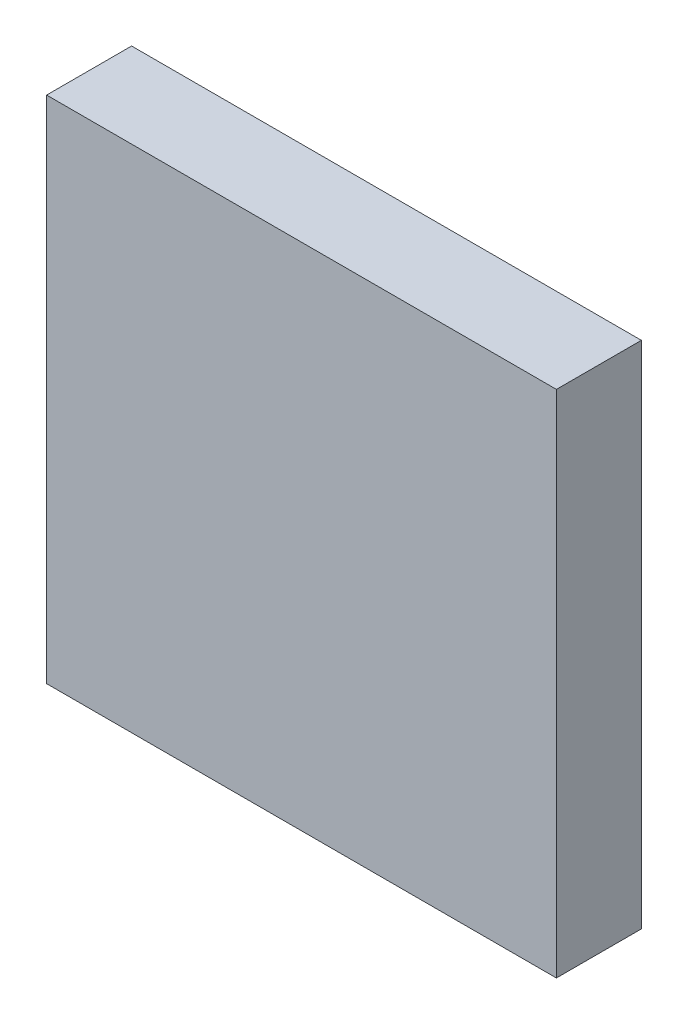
ISO-10303-21;
HEADER;
FILE_DESCRIPTION(('STEP AP214'),'2;1');
FILE_NAME('part.step','',(''),(''),'','','');
FILE_SCHEMA(('AUTOMOTIVE_DESIGN { 1 0 10303 214 1 1 1 1 }'));
ENDSEC;
DATA;
#1=APPLICATION_CONTEXT('core data for automotive mechanical design processes');
#2=APPLICATION_PROTOCOL_DEFINITION('international standard','automotive_design',2000,#1);
#3=PRODUCT_CONTEXT('',#1,'mechanical');
#4=PRODUCT('Part','Part','',(#3));
#5=PRODUCT_RELATED_PRODUCT_CATEGORY('part','',(#4));
#6=PRODUCT_DEFINITION_FORMATION('','',#4);
#7=PRODUCT_DEFINITION_CONTEXT('part definition',#1,'design');
#8=PRODUCT_DEFINITION('design','',#6,#7);
#9=PRODUCT_DEFINITION_SHAPE('','',#8);
#10=(LENGTH_UNIT() NAMED_UNIT(*) SI_UNIT(.MILLI.,.METRE.));
#11=(NAMED_UNIT(*) PLANE_ANGLE_UNIT() SI_UNIT($,.RADIAN.));
#12=(NAMED_UNIT(*) SI_UNIT($,.STERADIAN.) SOLID_ANGLE_UNIT());
#13=UNCERTAINTY_MEASURE_WITH_UNIT(LENGTH_MEASURE(1.E-05),#10,'distance_accuracy_value','');
#14=(GEOMETRIC_REPRESENTATION_CONTEXT(3) GLOBAL_UNCERTAINTY_ASSIGNED_CONTEXT((#13)) GLOBAL_UNIT_ASSIGNED_CONTEXT((#10,
#11,#12)) REPRESENTATION_CONTEXT('',''));
#15=CARTESIAN_POINT('',(0.,0.,0.));
#16=DIRECTION('',(0.,0.,1.));
#17=DIRECTION('',(1.,0.,0.));
#18=AXIS2_PLACEMENT_3D('',#15,#16,#17);
#19=CARTESIAN_POINT('',(0.,0.,1.));
#20=DIRECTION('',(0.,0.,1.));
#21=DIRECTION('',(1.,0.,0.));
#22=AXIS2_PLACEMENT_3D('',#19,#20,#21);
#23=PLANE('',#22);
#24=DIRECTION('',(0.,1.,0.));
#25=VECTOR('',#24,1.);
#26=CARTESIAN_POINT('',(-3.,3.,1.));
#27=LINE('',#26,#25);
#28=CARTESIAN_POINT('',(-3.,-3.,1.));
#29=VERTEX_POINT('',#28);
#30=CARTESIAN_POINT('',(-3.,3.,1.));
#31=VERTEX_POINT('',#30);
#32=EDGE_CURVE('E67',#29,#31,#27,.T.);
#33=ORIENTED_EDGE('',*,*,#32,.F.);
#34=DIRECTION('',(1.,0.,0.));
#35=VECTOR('',#34,1.);
#36=CARTESIAN_POINT('',(-3.,-3.,1.));
#37=LINE('',#36,#35);
#38=CARTESIAN_POINT('',(3.,-3.,1.));
#39=VERTEX_POINT('',#38);
#40=EDGE_CURVE('E19',#39,#29,#37,.F.);
#41=ORIENTED_EDGE('',*,*,#40,.F.);
#42=DIRECTION('',(0.,1.,0.));
#43=VECTOR('',#42,1.);
#44=CARTESIAN_POINT('',(3.,-3.,1.));
#45=LINE('',#44,#43);
#46=CARTESIAN_POINT('',(3.,3.,1.));
#47=VERTEX_POINT('',#46);
#48=EDGE_CURVE('E57',#47,#39,#45,.F.);
#49=ORIENTED_EDGE('',*,*,#48,.F.);
#50=DIRECTION('',(1.,0.,0.));
#51=VECTOR('',#50,1.);
#52=CARTESIAN_POINT('',(3.,3.,1.));
#53=LINE('',#52,#51);
#54=EDGE_CURVE('E52',#31,#47,#53,.T.);
#55=ORIENTED_EDGE('',*,*,#54,.F.);
#56=EDGE_LOOP('',(#33,#41,#49,#55));
#57=FACE_BOUND('',#56,.T.);
#58=ADVANCED_FACE('F16',(#57),#23,.T.);
#59=CARTESIAN_POINT('',(-3.,-3.,0.));
#60=DIRECTION('',(0.,-1.,0.));
#61=DIRECTION('',(0.,0.,-1.));
#62=AXIS2_PLACEMENT_3D('',#59,#60,#61);
#63=PLANE('',#62);
#64=DIRECTION('',(0.,0.,1.));
#65=VECTOR('',#64,1.);
#66=CARTESIAN_POINT('',(-3.,-3.,0.));
#67=LINE('',#66,#65);
#68=CARTESIAN_POINT('',(-3.,-3.,0.));
#69=VERTEX_POINT('',#68);
#70=EDGE_CURVE('E78',#69,#29,#67,.T.);
#71=ORIENTED_EDGE('',*,*,#70,.F.);
#72=DIRECTION('',(1.,0.,0.));
#73=VECTOR('',#72,1.);
#74=CARTESIAN_POINT('',(0.,-3.,0.));
#75=LINE('',#74,#73);
#76=CARTESIAN_POINT('',(3.,-3.,0.));
#77=VERTEX_POINT('',#76);
#78=EDGE_CURVE('E73',#69,#77,#75,.T.);
#79=ORIENTED_EDGE('',*,*,#78,.T.);
#80=DIRECTION('',(0.,0.,-1.));
#81=VECTOR('',#80,1.);
#82=CARTESIAN_POINT('',(3.,-3.,0.));
#83=LINE('',#82,#81);
#84=EDGE_CURVE('E62',#39,#77,#83,.T.);
#85=ORIENTED_EDGE('',*,*,#84,.F.);
#86=ORIENTED_EDGE('',*,*,#40,.T.);
#87=EDGE_LOOP('',(#71,#79,#85,#86));
#88=FACE_BOUND('',#87,.T.);
#89=ADVANCED_FACE('F72',(#88),#63,.T.);
#90=CARTESIAN_POINT('',(3.,-3.,0.));
#91=DIRECTION('',(1.,0.,0.));
#92=DIRECTION('',(0.,0.,-1.));
#93=AXIS2_PLACEMENT_3D('',#90,#91,#92);
#94=PLANE('',#93);
#95=ORIENTED_EDGE('',*,*,#84,.T.);
#96=DIRECTION('',(0.,1.,0.));
#97=VECTOR('',#96,1.);
#98=CARTESIAN_POINT('',(3.,0.,0.));
#99=LINE('',#98,#97);
#100=CARTESIAN_POINT('',(3.,3.,0.));
#101=VERTEX_POINT('',#100);
#102=EDGE_CURVE('E83',#77,#101,#99,.T.);
#103=ORIENTED_EDGE('',*,*,#102,.T.);
#104=DIRECTION('',(0.,0.,1.));
#105=VECTOR('',#104,1.);
#106=CARTESIAN_POINT('',(3.,3.,0.));
#107=LINE('',#106,#105);
#108=EDGE_CURVE('E64',#47,#101,#107,.F.);
#109=ORIENTED_EDGE('',*,*,#108,.F.);
#110=ORIENTED_EDGE('',*,*,#48,.T.);
#111=EDGE_LOOP('',(#95,#103,#109,#110));
#112=FACE_BOUND('',#111,.T.);
#113=ADVANCED_FACE('F59',(#112),#94,.T.);
#114=CARTESIAN_POINT('',(3.,3.,0.));
#115=DIRECTION('',(0.,1.,0.));
#116=DIRECTION('',(0.,0.,1.));
#117=AXIS2_PLACEMENT_3D('',#114,#115,#116);
#118=PLANE('',#117);
#119=ORIENTED_EDGE('',*,*,#108,.T.);
#120=DIRECTION('',(1.,0.,0.));
#121=VECTOR('',#120,1.);
#122=CARTESIAN_POINT('',(0.,3.,0.));
#123=LINE('',#122,#121);
#124=CARTESIAN_POINT('',(-3.,3.,0.));
#125=VERTEX_POINT('',#124);
#126=EDGE_CURVE('E25',#101,#125,#123,.F.);
#127=ORIENTED_EDGE('',*,*,#126,.T.);
#128=DIRECTION('',(0.,0.,1.));
#129=VECTOR('',#128,1.);
#130=CARTESIAN_POINT('',(-3.,3.,0.));
#131=LINE('',#130,#129);
#132=EDGE_CURVE('E33',#31,#125,#131,.F.);
#133=ORIENTED_EDGE('',*,*,#132,.F.);
#134=ORIENTED_EDGE('',*,*,#54,.T.);
#135=EDGE_LOOP('',(#119,#127,#133,#134));
#136=FACE_BOUND('',#135,.T.);
#137=ADVANCED_FACE('F87',(#136),#118,.T.);
#138=CARTESIAN_POINT('',(-3.,3.,0.));
#139=DIRECTION('',(-1.,0.,0.));
#140=DIRECTION('',(0.,0.,1.));
#141=AXIS2_PLACEMENT_3D('',#138,#139,#140);
#142=PLANE('',#141);
#143=ORIENTED_EDGE('',*,*,#132,.T.);
#144=DIRECTION('',(0.,1.,0.));
#145=VECTOR('',#144,1.);
#146=CARTESIAN_POINT('',(-3.,0.,0.));
#147=LINE('',#146,#145);
#148=EDGE_CURVE('E11',#125,#69,#147,.F.);
#149=ORIENTED_EDGE('',*,*,#148,.T.);
#150=ORIENTED_EDGE('',*,*,#70,.T.);
#151=ORIENTED_EDGE('',*,*,#32,.T.);
#152=EDGE_LOOP('',(#143,#149,#150,#151));
#153=FACE_BOUND('',#152,.T.);
#154=ADVANCED_FACE('F90',(#153),#142,.T.);
#155=CARTESIAN_POINT('',(0.,0.,0.));
#156=DIRECTION('',(0.,0.,1.));
#157=DIRECTION('',(1.,0.,0.));
#158=AXIS2_PLACEMENT_3D('',#155,#156,#157);
#159=PLANE('',#158);
#160=ORIENTED_EDGE('',*,*,#126,.F.);
#161=ORIENTED_EDGE('',*,*,#102,.F.);
#162=ORIENTED_EDGE('',*,*,#78,.F.);
#163=ORIENTED_EDGE('',*,*,#148,.F.);
#164=EDGE_LOOP('',(#160,#161,#162,#163));
#165=FACE_BOUND('',#164,.T.);
#166=ADVANCED_FACE('F89',(#165),#159,.F.);
#167=CLOSED_SHELL('',(#58,#89,#113,#137,#154,#166));
#168=MANIFOLD_SOLID_BREP('B1',#167);
#169=ADVANCED_BREP_SHAPE_REPRESENTATION('',(#18,#168),#14);
#170=SHAPE_DEFINITION_REPRESENTATION(#9,#169);
ENDSEC;
END-ISO-10303-21;
